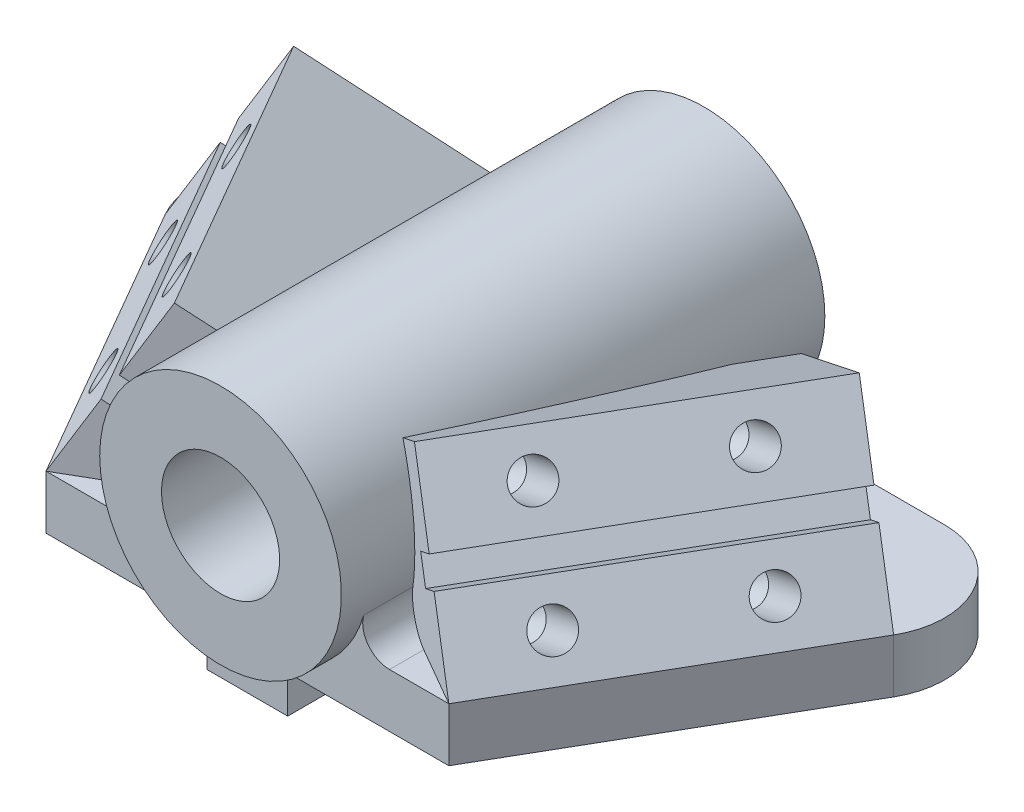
from build123d import *

# Parameters (mm, degrees)
EXTRUDE1_DEPTH                 = 10
EXTRUDE2_START                 = -85
SKETCH2_R                      = 22.5
SKETCH2_R_2                    = 11
EXTRUDE2_DEPTH                 = 90
FILLET1_R                      = 5
EXTRUDE4_DEPTH                 = 33.962941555
SKETCH4_R                      = 11
CUT_EXTRUDE1_DEPTH             = 119.848236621
EXTRUDE5_START                 = -75
SKETCH5_W                      = 15
SKETCH5_H                      = 7
EXTRUDE5_DEPTH                 = 75
CUT_EXTRUDE2_DEPTH             = 5
M8X1_0_TAPPED_HOLE1_AT_2_COUNT = 2
M8X1_0_TAPPED_HOLE1_AT_2_PITCH = 30.310889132
M8X1_0_TAPPED_HOLE1_AT_3_COUNT = 2
M8X1_0_TAPPED_HOLE1_AT_3_PITCH = 36.314597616
M8X1_0_TAPPED_HOLE1_AT_4_COUNT = 2
M8X1_0_TAPPED_HOLE1_AT_4_PITCH = 20


with BuildPart() as part:
    # Sketch1 → Extrude1 (new body)
    with BuildSketch(Plane(origin=(0, 0, 0), x_dir=(1, 0, 0), z_dir=(0, 1, 0))):
        with BuildLine():
            Line((-37.5, 0), (37.5, 0))
            Line((37.5, 0), (67.810889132, 52.5))
            ThreePointArc((67.810889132, 52.5), (67.810889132, 67.5), (54.820508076, 75))
            Line((54.820508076, 75), (-54.820508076, 75))
            ThreePointArc((-54.820508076, 75), (-67.810889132, 67.5), (-67.810889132, 52.5))
            Line((-67.810889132, 52.5), (-37.5, 0))
        make_face()
    extrude(amount=EXTRUDE1_DEPTH)

    # Sketch2 → Extrude2 (add)
    with BuildSketch(Plane.XY.offset(EXTRUDE2_START)):
        with Locations(Location((0, 22.5, 0), (0, 0, 180))):
            Circle(SKETCH2_R)
        with Locations(Location((0, 22.5, 0), (0, 0, 180))):
            Circle(SKETCH2_R_2, mode=Mode.SUBTRACT)
    extrude(amount=EXTRUDE2_DEPTH)

    # Fillet1
    fillet1_edges = [part.edges().sort_by_distance(p)[0] for p in [
        (-18.708286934, 10, -37.5),
        (18.708286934, 10, -37.5),
    ]]
    fillet(fillet1_edges, radius=FILLET1_R)

    # Sketch3 → Extrude4 (add)
    with BuildSketch(Plane(origin=(24.84375, 16.5625, 14.34354575), x_dir=(0.33145666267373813, 0.2824188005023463, -0.9002089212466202), z_dir=(0.7500000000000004, 0.5000000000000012, 0.43301270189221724))):
        Polygon((72.561527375, -33.047326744), (83.97534731, 0.039297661), (26.66763279, 19.808613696), (15.253812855, -13.278010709), align=None)
    extrude4 = extrude(amount=-EXTRUDE4_DEPTH)

    # Mirror1: Extrude4 across plane
    add(extrude4.mirror(Plane(origin=(0, 0, 0), x_dir=(0, 0, 1), z_dir=(1, 0, 0))))

    # Sketch4 → Cut-Extrude1 (cut, through all)
    with BuildSketch(Plane.XY):
        with Locations(Location((0, 22.5, 0), (0, 0, 180))):
            Circle(SKETCH4_R)
        Polygon((0, 0), (69.820508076, 0), (69.820508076, -6.981470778), (-69.820508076, -6.981470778), (-69.820508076, 0), align=None)
    extrude(amount=-CUT_EXTRUDE1_DEPTH, mode=Mode.SUBTRACT)

    # Sketch5 → Extrude5 (add)
    with BuildSketch(Plane.XY.offset(EXTRUDE5_START)):
        with Locations((0, -3.5)):
            Rectangle(SKETCH5_W, SKETCH5_H)
    extrude(amount=EXTRUDE5_DEPTH)

    # Sketch6 → Cut-Extrude2 (cut)
    with BuildSketch(Plane(origin=(24.84375, 16.5625, 14.34354575), x_dir=(0.3314566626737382, 0.28241880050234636, -0.9002089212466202), z_dir=(0.7500000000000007, 0.5000000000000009, 0.4330127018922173))):
        Polygon((20.14544997, 0.901971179), (21.775995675, 5.628631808), (79.083710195, -14.140684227), (77.45316449, -18.867344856), align=None)
    cut_extrude2 = extrude(amount=-CUT_EXTRUDE2_DEPTH, mode=Mode.SUBTRACT)

    # Sketch7 → M8x1.0 Tapped Hole1 (revolve, cut)
    with BuildSketch(Plane(origin=(33.169872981, 33.815698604, -20), x_dir=(-0.03556529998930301, 0.6841911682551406, -0.7284350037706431), z_dir=(-0.6604809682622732, 0.5309260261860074, 0.5309260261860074))):
        Polygon((0, 0), (0, 21.103012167), (3.5, 19), (3.5, 0), align=None)
    m8x1_0_tapped_hole1 = revolve(axis=Axis((37.932372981, 36.990698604, -17.250369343), (-0.7500000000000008, -0.5000000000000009, -0.4330127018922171)), mode=Mode.SUBTRACT)

    # M8x1.0 Tapped Hole1 at 2: M8x1.0 Tapped Hole1 ×2
    with Locations(*[Vector(0.49999999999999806, 0, -0.8660254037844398) * (i * M8X1_0_TAPPED_HOLE1_AT_2_PITCH) for i in range(1, M8X1_0_TAPPED_HOLE1_AT_2_COUNT)]):
        add(m8x1_0_tapped_hole1, mode=Mode.SUBTRACT)

    # M8x1.0 Tapped Hole1 at 3: M8x1.0 Tapped Hole1 ×2
    with Locations(*[Vector(0.6558161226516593, -0.47695718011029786, -0.5851641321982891) * (i * M8X1_0_TAPPED_HOLE1_AT_3_PITCH) for i in range(1, M8X1_0_TAPPED_HOLE1_AT_3_COUNT)]):
        add(m8x1_0_tapped_hole1, mode=Mode.SUBTRACT)

    # M8x1.0 Tapped Hole1 at 4: M8x1.0 Tapped Hole1 ×2
    with Locations(*[Vector(0.43301270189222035, -0.8660254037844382, 0.24999999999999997) * (i * M8X1_0_TAPPED_HOLE1_AT_4_PITCH) for i in range(1, M8X1_0_TAPPED_HOLE1_AT_4_COUNT)]):
        add(m8x1_0_tapped_hole1, mode=Mode.SUBTRACT)

    # Mirror2: Cut-Extrude2, M8x1.0 Tapped Hole1 across plane
    add(cut_extrude2.mirror(Plane(origin=(0, 0, 0), x_dir=(0, 0, 1), z_dir=(1, 0, 0))), mode=Mode.SUBTRACT)
    add(m8x1_0_tapped_hole1.mirror(Plane(origin=(0, 0, 0), x_dir=(0, 0, 1), z_dir=(1, 0, 0))), mode=Mode.SUBTRACT)

    # Mirror2 copy 1 sketch → Mirror2 copy 1 (revolve, cut)
    with BuildSketch(Plane(origin=(-48.325317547, 33.815698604, -46.25), x_dir=(0.03556529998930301, 0.6841911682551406, -0.7284350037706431), z_dir=(0.6604809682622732, 0.5309260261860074, 0.5309260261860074))):
        Polygon((0, 0), (0, -21.103012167), (3.5, -19), (3.5, 0), align=None)
    revolve(axis=Axis((-53.087817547, 36.990698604, -43.500369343), (-0.7500000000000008, 0.5000000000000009, 0.4330127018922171)), mode=Mode.SUBTRACT)

    # Mirror2 copy 2 sketch → Mirror2 copy 2 (revolve, cut)
    with BuildSketch(Plane(origin=(-56.985571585, 16.495190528, -41.25), x_dir=(0.03556529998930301, 0.6841911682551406, -0.7284350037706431), z_dir=(0.6604809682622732, 0.5309260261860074, 0.5309260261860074))):
        Polygon((0, 0), (0, -21.103012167), (3.5, -19), (3.5, 0), align=None)
    revolve(axis=Axis((-61.748071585, 19.670190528, -38.500369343), (-0.7500000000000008, 0.5000000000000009, 0.4330127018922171)), mode=Mode.SUBTRACT)

    # Mirror2 copy 3 sketch → Mirror2 copy 3 (revolve, cut)
    with BuildSketch(Plane(origin=(-41.830127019, 16.495190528, -15), x_dir=(0.03556529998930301, 0.6841911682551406, -0.7284350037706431), z_dir=(0.6604809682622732, 0.5309260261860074, 0.5309260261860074))):
        Polygon((0, 0), (0, -21.103012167), (3.5, -19), (3.5, 0), align=None)
    revolve(axis=Axis((-46.592627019, 19.670190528, -12.250369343), (-0.7500000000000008, 0.5000000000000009, 0.4330127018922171)), mode=Mode.SUBTRACT)


solid = part.part
